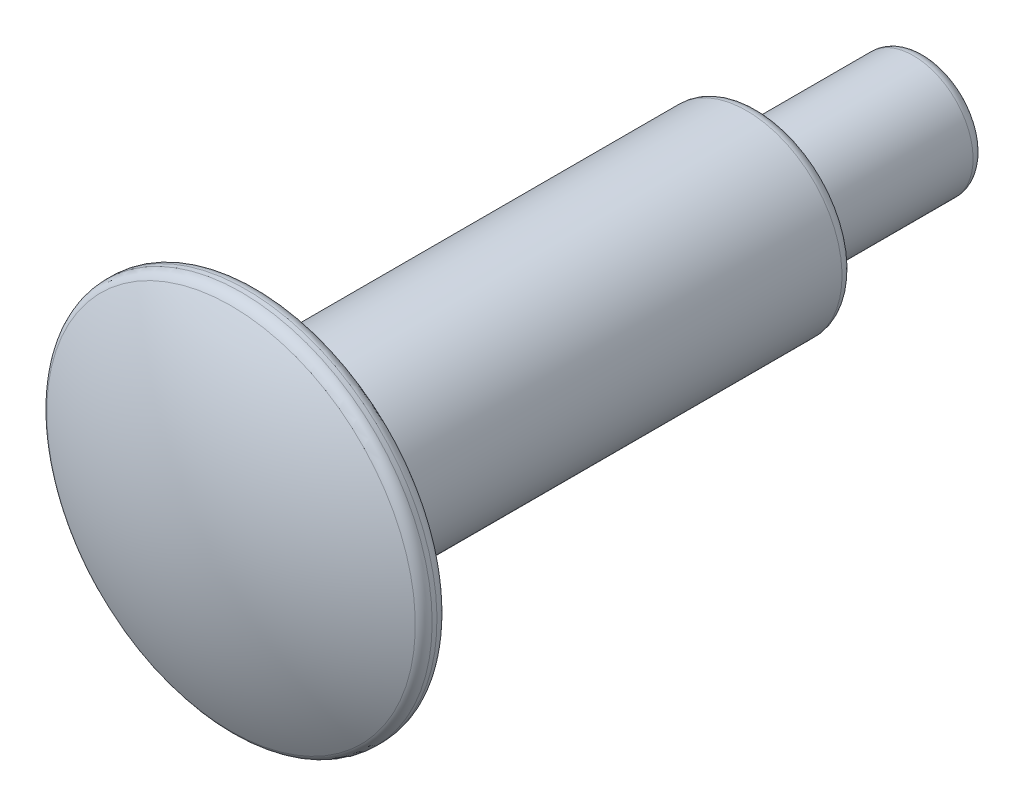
ISO-10303-21;
HEADER;
FILE_DESCRIPTION(('STEP AP214'),'2;1');
FILE_NAME('part.step','',(''),(''),'','','');
FILE_SCHEMA(('AUTOMOTIVE_DESIGN { 1 0 10303 214 1 1 1 1 }'));
ENDSEC;
DATA;
#1=APPLICATION_CONTEXT('core data for automotive mechanical design processes');
#2=APPLICATION_PROTOCOL_DEFINITION('international standard','automotive_design',2000,#1);
#3=PRODUCT_CONTEXT('',#1,'mechanical');
#4=PRODUCT('Part','Part','',(#3));
#5=PRODUCT_RELATED_PRODUCT_CATEGORY('part','',(#4));
#6=PRODUCT_DEFINITION_FORMATION('','',#4);
#7=PRODUCT_DEFINITION_CONTEXT('part definition',#1,'design');
#8=PRODUCT_DEFINITION('design','',#6,#7);
#9=PRODUCT_DEFINITION_SHAPE('','',#8);
#10=(LENGTH_UNIT() NAMED_UNIT(*) SI_UNIT(.MILLI.,.METRE.));
#11=(NAMED_UNIT(*) PLANE_ANGLE_UNIT() SI_UNIT($,.RADIAN.));
#12=(NAMED_UNIT(*) SI_UNIT($,.STERADIAN.) SOLID_ANGLE_UNIT());
#13=UNCERTAINTY_MEASURE_WITH_UNIT(LENGTH_MEASURE(1.E-05),#10,'distance_accuracy_value','');
#14=(GEOMETRIC_REPRESENTATION_CONTEXT(3) GLOBAL_UNCERTAINTY_ASSIGNED_CONTEXT((#13)) GLOBAL_UNIT_ASSIGNED_CONTEXT((#10,
#11,#12)) REPRESENTATION_CONTEXT('',''));
#15=CARTESIAN_POINT('',(0.,0.,0.));
#16=DIRECTION('',(0.,0.,1.));
#17=DIRECTION('',(1.,0.,0.));
#18=AXIS2_PLACEMENT_3D('',#15,#16,#17);
#19=CARTESIAN_POINT('',(0.,0.,-0.965434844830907));
#20=DIRECTION('',(0.,0.,1.));
#21=DIRECTION('',(0.,1.,0.));
#22=AXIS2_PLACEMENT_3D('',#19,#20,#21);
#23=SPHERICAL_SURFACE('',#22,16.5);
#24=CARTESIAN_POINT('',(0.,0.,13.6095246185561));
#25=DIRECTION('',(0.,0.,-1.));
#26=DIRECTION('',(0.,1.,0.));
#27=AXIS2_PLACEMENT_3D('',#24,#25,#26);
#28=CIRCLE('',#27,7.734375);
#29=CARTESIAN_POINT('',(0.,7.734375,13.6095246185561));
#30=VERTEX_POINT('',#29);
#31=EDGE_CURVE('E40',#30,#30,#28,.F.);
#32=ORIENTED_EDGE('',*,*,#31,.T.);
#33=EDGE_LOOP('',(#32));
#34=FACE_BOUND('',#33,.T.);
#35=ADVANCED_FACE('F29',(#34),#23,.T.);
#36=CARTESIAN_POINT('',(0.,0.,-15.5345651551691));
#37=DIRECTION('',(0.,0.,1.));
#38=DIRECTION('',(0.,-1.,0.));
#39=AXIS2_PLACEMENT_3D('',#36,#37,#38);
#40=PLANE('',#39);
#41=CARTESIAN_POINT('',(0.,0.,-15.5345651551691));
#42=DIRECTION('',(0.,0.,1.));
#43=DIRECTION('',(0.,-1.,0.));
#44=AXIS2_PLACEMENT_3D('',#41,#42,#43);
#45=CIRCLE('',#44,2.);
#46=CARTESIAN_POINT('',(0.,-1.99999999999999,-15.5345651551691));
#47=VERTEX_POINT('',#46);
#48=EDGE_CURVE('E64',#47,#47,#45,.F.);
#49=ORIENTED_EDGE('',*,*,#48,.T.);
#50=EDGE_LOOP('',(#49));
#51=FACE_BOUND('',#50,.T.);
#52=ADVANCED_FACE('F122',(#51),#40,.F.);
#53=CARTESIAN_POINT('',(0.,0.,15.5345651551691));
#54=DIRECTION('',(0.,0.,1.));
#55=DIRECTION('',(0.,-1.,0.));
#56=AXIS2_PLACEMENT_3D('',#53,#54,#55);
#57=CYLINDRICAL_SURFACE('',#56,2.5);
#58=CARTESIAN_POINT('',(0.,0.,-15.0345651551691));
#59=DIRECTION('',(0.,0.,1.));
#60=DIRECTION('',(0.,-1.,0.));
#61=AXIS2_PLACEMENT_3D('',#58,#59,#60);
#62=CIRCLE('',#61,2.5);
#63=CARTESIAN_POINT('',(0.,-2.49999999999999,-15.0345651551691));
#64=VERTEX_POINT('',#63);
#65=EDGE_CURVE('E67',#64,#64,#62,.T.);
#66=ORIENTED_EDGE('',*,*,#65,.T.);
#67=EDGE_LOOP('',(#66));
#68=FACE_BOUND('',#67,.T.);
#69=CARTESIAN_POINT('',(0.,0.,-9.0345651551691));
#70=DIRECTION('',(0.,0.,1.));
#71=DIRECTION('',(0.,-1.,0.));
#72=AXIS2_PLACEMENT_3D('',#69,#70,#71);
#73=CIRCLE('',#72,2.5);
#74=CARTESIAN_POINT('',(0.,-2.49999999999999,-9.0345651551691));
#75=VERTEX_POINT('',#74);
#76=EDGE_CURVE('E70',#75,#75,#73,.F.);
#77=ORIENTED_EDGE('',*,*,#76,.T.);
#78=EDGE_LOOP('',(#77));
#79=FACE_BOUND('',#78,.T.);
#80=ADVANCED_FACE('F74',(#68,#79),#57,.T.);
#81=CARTESIAN_POINT('',(0.,2.5,-8.5345651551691));
#82=DIRECTION('',(0.,0.,1.));
#83=DIRECTION('',(0.,-1.,0.));
#84=AXIS2_PLACEMENT_3D('',#81,#82,#83);
#85=PLANE('',#84);
#86=CARTESIAN_POINT('',(0.,0.,-8.5345651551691));
#87=DIRECTION('',(0.,0.,1.));
#88=DIRECTION('',(0.,-1.,0.));
#89=AXIS2_PLACEMENT_3D('',#86,#87,#88);
#90=CIRCLE('',#89,3.);
#91=CARTESIAN_POINT('',(0.,-2.99999999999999,-8.5345651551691));
#92=VERTEX_POINT('',#91);
#93=EDGE_CURVE('E58',#92,#92,#90,.T.);
#94=ORIENTED_EDGE('',*,*,#93,.T.);
#95=EDGE_LOOP('',(#94));
#96=FACE_BOUND('',#95,.T.);
#97=CARTESIAN_POINT('',(0.,0.,-8.5345651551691));
#98=DIRECTION('',(0.,0.,1.));
#99=DIRECTION('',(0.,-1.,0.));
#100=AXIS2_PLACEMENT_3D('',#97,#98,#99);
#101=CIRCLE('',#100,3.5);
#102=CARTESIAN_POINT('',(0.,-3.49999999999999,-8.5345651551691));
#103=VERTEX_POINT('',#102);
#104=EDGE_CURVE('E61',#103,#103,#101,.F.);
#105=ORIENTED_EDGE('',*,*,#104,.T.);
#106=EDGE_LOOP('',(#105));
#107=FACE_BOUND('',#106,.T.);
#108=ADVANCED_FACE('F84',(#96,#107),#85,.F.);
#109=CARTESIAN_POINT('',(0.,0.,15.5345651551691));
#110=DIRECTION('',(0.,0.,1.));
#111=DIRECTION('',(0.,-1.,0.));
#112=AXIS2_PLACEMENT_3D('',#109,#110,#111);
#113=CYLINDRICAL_SURFACE('',#112,4.);
#114=CARTESIAN_POINT('',(0.,0.,-8.0345651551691));
#115=DIRECTION('',(0.,0.,1.));
#116=DIRECTION('',(0.,-1.,0.));
#117=AXIS2_PLACEMENT_3D('',#114,#115,#116);
#118=CIRCLE('',#117,4.);
#119=CARTESIAN_POINT('',(0.,-3.99999999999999,-8.0345651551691));
#120=VERTEX_POINT('',#119);
#121=EDGE_CURVE('E52',#120,#120,#118,.T.);
#122=ORIENTED_EDGE('',*,*,#121,.T.);
#123=EDGE_LOOP('',(#122));
#124=FACE_BOUND('',#123,.T.);
#125=CARTESIAN_POINT('',(0.,0.,11.9654348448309));
#126=DIRECTION('',(0.,0.,1.));
#127=DIRECTION('',(0.,-1.,0.));
#128=AXIS2_PLACEMENT_3D('',#125,#126,#127);
#129=CIRCLE('',#128,4.);
#130=CARTESIAN_POINT('',(0.,-3.99999999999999,11.9654348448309));
#131=VERTEX_POINT('',#130);
#132=EDGE_CURVE('E55',#131,#131,#129,.F.);
#133=ORIENTED_EDGE('',*,*,#132,.T.);
#134=EDGE_LOOP('',(#133));
#135=FACE_BOUND('',#134,.T.);
#136=ADVANCED_FACE('F87',(#124,#135),#113,.T.);
#137=CARTESIAN_POINT('',(0.,4.,12.4654348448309));
#138=DIRECTION('',(0.,0.,1.));
#139=DIRECTION('',(0.,-1.,0.));
#140=AXIS2_PLACEMENT_3D('',#137,#138,#139);
#141=PLANE('',#140);
#142=CARTESIAN_POINT('',(0.,0.,12.4654348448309));
#143=DIRECTION('',(0.,0.,1.));
#144=DIRECTION('',(0.,-1.,0.));
#145=AXIS2_PLACEMENT_3D('',#142,#143,#144);
#146=CIRCLE('',#145,4.5);
#147=CARTESIAN_POINT('',(0.,-4.49999999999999,12.4654348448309));
#148=VERTEX_POINT('',#147);
#149=EDGE_CURVE('E44',#148,#148,#146,.T.);
#150=ORIENTED_EDGE('',*,*,#149,.T.);
#151=EDGE_LOOP('',(#150));
#152=FACE_BOUND('',#151,.T.);
#153=CARTESIAN_POINT('',(0.,0.,12.4654348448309));
#154=DIRECTION('',(0.,0.,1.));
#155=DIRECTION('',(0.,-1.,0.));
#156=AXIS2_PLACEMENT_3D('',#153,#154,#155);
#157=CIRCLE('',#156,7.5);
#158=CARTESIAN_POINT('',(0.,-7.5,12.4654348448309));
#159=VERTEX_POINT('',#158);
#160=EDGE_CURVE('E49',#159,#159,#157,.F.);
#161=ORIENTED_EDGE('',*,*,#160,.T.);
#162=EDGE_LOOP('',(#161));
#163=FACE_BOUND('',#162,.T.);
#164=ADVANCED_FACE('F99',(#152,#163),#141,.F.);
#165=CARTESIAN_POINT('',(0.,0.,15.5345651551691));
#166=DIRECTION('',(0.,0.,1.));
#167=DIRECTION('',(0.,-1.,0.));
#168=AXIS2_PLACEMENT_3D('',#165,#166,#167);
#169=CYLINDRICAL_SURFACE('',#168,8.);
#170=CARTESIAN_POINT('',(0.,0.,13.1678591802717));
#171=DIRECTION('',(0.,0.,-1.));
#172=DIRECTION('',(0.,1.,0.));
#173=AXIS2_PLACEMENT_3D('',#170,#171,#172);
#174=CIRCLE('',#173,8.);
#175=CARTESIAN_POINT('',(0.,8.,13.1678591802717));
#176=VERTEX_POINT('',#175);
#177=EDGE_CURVE('E10',#176,#176,#174,.T.);
#178=ORIENTED_EDGE('',*,*,#177,.T.);
#179=EDGE_LOOP('',(#178));
#180=FACE_BOUND('',#179,.T.);
#181=CARTESIAN_POINT('',(0.,0.,12.9654348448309));
#182=DIRECTION('',(0.,0.,1.));
#183=DIRECTION('',(0.,-1.,0.));
#184=AXIS2_PLACEMENT_3D('',#181,#182,#183);
#185=CIRCLE('',#184,8.);
#186=CARTESIAN_POINT('',(0.,-8.,12.9654348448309));
#187=VERTEX_POINT('',#186);
#188=EDGE_CURVE('E36',#187,#187,#185,.T.);
#189=ORIENTED_EDGE('',*,*,#188,.T.);
#190=EDGE_LOOP('',(#189));
#191=FACE_BOUND('',#190,.T.);
#192=ADVANCED_FACE('F111',(#180,#191),#169,.T.);
#193=CARTESIAN_POINT('',(0.,0.,-15.0345651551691));
#194=DIRECTION('',(0.,0.,1.));
#195=DIRECTION('',(0.,-1.,0.));
#196=AXIS2_PLACEMENT_3D('',#193,#194,#195);
#197=TOROIDAL_SURFACE('',#196,2.,0.5);
#198=ORIENTED_EDGE('',*,*,#48,.F.);
#199=EDGE_LOOP('',(#198));
#200=FACE_BOUND('',#199,.T.);
#201=ORIENTED_EDGE('',*,*,#65,.F.);
#202=EDGE_LOOP('',(#201));
#203=FACE_BOUND('',#202,.T.);
#204=ADVANCED_FACE('F80',(#200,#203),#197,.T.);
#205=CARTESIAN_POINT('',(0.,0.,-9.0345651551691));
#206=DIRECTION('',(0.,0.,1.));
#207=DIRECTION('',(0.,-1.,0.));
#208=AXIS2_PLACEMENT_3D('',#205,#206,#207);
#209=TOROIDAL_SURFACE('',#208,3.,0.5);
#210=ORIENTED_EDGE('',*,*,#76,.F.);
#211=EDGE_LOOP('',(#210));
#212=FACE_BOUND('',#211,.T.);
#213=ORIENTED_EDGE('',*,*,#93,.F.);
#214=EDGE_LOOP('',(#213));
#215=FACE_BOUND('',#214,.T.);
#216=ADVANCED_FACE('F76',(#212,#215),#209,.F.);
#217=CARTESIAN_POINT('',(0.,0.,-8.0345651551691));
#218=DIRECTION('',(0.,0.,1.));
#219=DIRECTION('',(0.,-1.,0.));
#220=AXIS2_PLACEMENT_3D('',#217,#218,#219);
#221=TOROIDAL_SURFACE('',#220,3.5,0.5);
#222=ORIENTED_EDGE('',*,*,#104,.F.);
#223=EDGE_LOOP('',(#222));
#224=FACE_BOUND('',#223,.T.);
#225=ORIENTED_EDGE('',*,*,#121,.F.);
#226=EDGE_LOOP('',(#225));
#227=FACE_BOUND('',#226,.T.);
#228=ADVANCED_FACE('F79',(#224,#227),#221,.T.);
#229=CARTESIAN_POINT('',(0.,0.,11.9654348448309));
#230=DIRECTION('',(0.,0.,1.));
#231=DIRECTION('',(0.,-1.,0.));
#232=AXIS2_PLACEMENT_3D('',#229,#230,#231);
#233=TOROIDAL_SURFACE('',#232,4.5,0.5);
#234=ORIENTED_EDGE('',*,*,#132,.F.);
#235=EDGE_LOOP('',(#234));
#236=FACE_BOUND('',#235,.T.);
#237=ORIENTED_EDGE('',*,*,#149,.F.);
#238=EDGE_LOOP('',(#237));
#239=FACE_BOUND('',#238,.T.);
#240=ADVANCED_FACE('F93',(#236,#239),#233,.F.);
#241=CARTESIAN_POINT('',(0.,0.,13.1678591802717));
#242=DIRECTION('',(0.,0.,-1.));
#243=DIRECTION('',(0.,1.,0.));
#244=AXIS2_PLACEMENT_3D('',#241,#242,#243);
#245=TOROIDAL_SURFACE('',#244,7.5,0.5);
#246=ORIENTED_EDGE('',*,*,#177,.F.);
#247=EDGE_LOOP('',(#246));
#248=FACE_BOUND('',#247,.T.);
#249=ORIENTED_EDGE('',*,*,#31,.F.);
#250=EDGE_LOOP('',(#249));
#251=FACE_BOUND('',#250,.T.);
#252=ADVANCED_FACE('F105',(#248,#251),#245,.T.);
#253=CARTESIAN_POINT('',(0.,0.,12.9654348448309));
#254=DIRECTION('',(0.,0.,1.));
#255=DIRECTION('',(0.,-1.,0.));
#256=AXIS2_PLACEMENT_3D('',#253,#254,#255);
#257=TOROIDAL_SURFACE('',#256,7.5,0.5);
#258=ORIENTED_EDGE('',*,*,#160,.F.);
#259=EDGE_LOOP('',(#258));
#260=FACE_BOUND('',#259,.T.);
#261=ORIENTED_EDGE('',*,*,#188,.F.);
#262=EDGE_LOOP('',(#261));
#263=FACE_BOUND('',#262,.T.);
#264=ADVANCED_FACE('F31',(#260,#263),#257,.T.);
#265=CLOSED_SHELL('',(#35,#52,#80,#108,#136,#164,#192,#204,#216,#228,#240,#252,#264));
#266=MANIFOLD_SOLID_BREP('B2',#265);
#267=ADVANCED_BREP_SHAPE_REPRESENTATION('',(#18,#266),#14);
#268=SHAPE_DEFINITION_REPRESENTATION(#9,#267);
ENDSEC;
END-ISO-10303-21;
